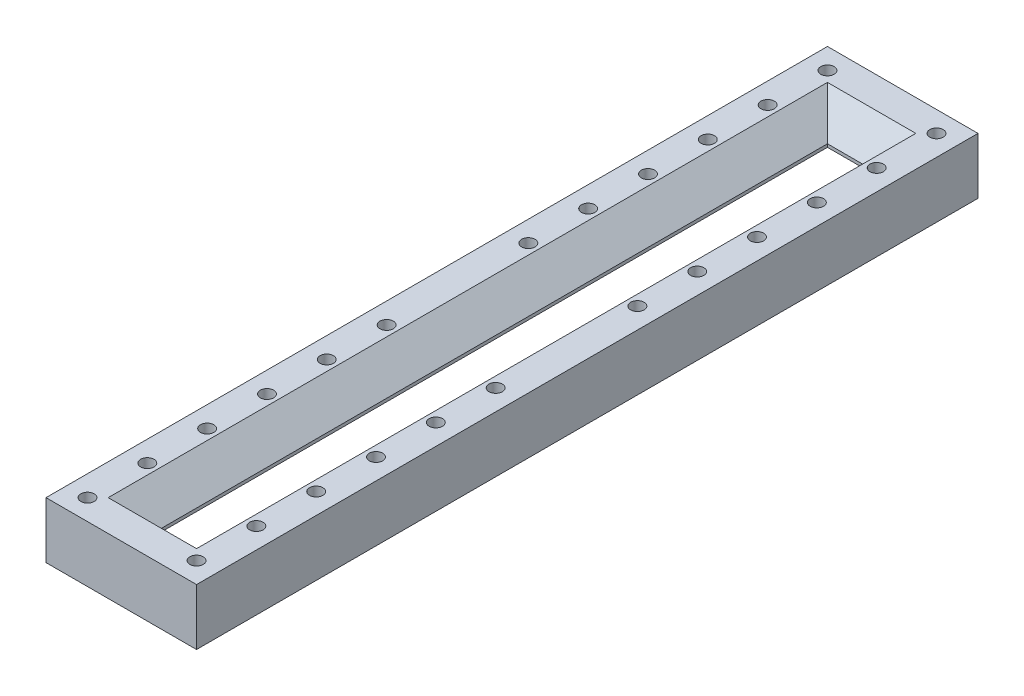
ISO-10303-21;
HEADER;
FILE_DESCRIPTION(('STEP AP214'),'2;1');
FILE_NAME('part.step','',(''),(''),'','','');
FILE_SCHEMA(('AUTOMOTIVE_DESIGN { 1 0 10303 214 1 1 1 1 }'));
ENDSEC;
DATA;
#1=APPLICATION_CONTEXT('core data for automotive mechanical design processes');
#2=APPLICATION_PROTOCOL_DEFINITION('international standard','automotive_design',2000,#1);
#3=PRODUCT_CONTEXT('',#1,'mechanical');
#4=PRODUCT('Part','Part','',(#3));
#5=PRODUCT_RELATED_PRODUCT_CATEGORY('part','',(#4));
#6=PRODUCT_DEFINITION_FORMATION('','',#4);
#7=PRODUCT_DEFINITION_CONTEXT('part definition',#1,'design');
#8=PRODUCT_DEFINITION('design','',#6,#7);
#9=PRODUCT_DEFINITION_SHAPE('','',#8);
#10=(LENGTH_UNIT() NAMED_UNIT(*) SI_UNIT(.MILLI.,.METRE.));
#11=(NAMED_UNIT(*) PLANE_ANGLE_UNIT() SI_UNIT($,.RADIAN.));
#12=(NAMED_UNIT(*) SI_UNIT($,.STERADIAN.) SOLID_ANGLE_UNIT());
#13=UNCERTAINTY_MEASURE_WITH_UNIT(LENGTH_MEASURE(1.E-05),#10,'distance_accuracy_value','');
#14=(GEOMETRIC_REPRESENTATION_CONTEXT(3) GLOBAL_UNCERTAINTY_ASSIGNED_CONTEXT((#13)) GLOBAL_UNIT_ASSIGNED_CONTEXT((#10,
#11,#12)) REPRESENTATION_CONTEXT('',''));
#15=CARTESIAN_POINT('',(0.,0.,0.));
#16=DIRECTION('',(0.,0.,1.));
#17=DIRECTION('',(1.,0.,0.));
#18=AXIS2_PLACEMENT_3D('',#15,#16,#17);
#19=CARTESIAN_POINT('',(0.,254.,0.));
#20=DIRECTION('',(0.,1.,0.));
#21=DIRECTION('',(0.,0.,1.));
#22=AXIS2_PLACEMENT_3D('',#19,#20,#21);
#23=PLANE('',#22);
#24=DIRECTION('',(1.,0.,0.));
#25=VECTOR('',#24,1.);
#26=CARTESIAN_POINT('',(0.,254.,-1623.175));
#27=LINE('',#26,#25);
#28=CARTESIAN_POINT('',(-199.374999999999,254.,-1623.175));
#29=VERTEX_POINT('',#28);
#30=CARTESIAN_POINT('',(199.375,254.,-1623.175));
#31=VERTEX_POINT('',#30);
#32=EDGE_CURVE('E187',#29,#31,#27,.T.);
#33=ORIENTED_EDGE('',*,*,#32,.T.);
#34=DIRECTION('',(0.,0.,1.));
#35=VECTOR('',#34,1.);
#36=CARTESIAN_POINT('',(199.375,254.,0.));
#37=LINE('',#36,#35);
#38=CARTESIAN_POINT('',(199.375,254.,1623.175));
#39=VERTEX_POINT('',#38);
#40=EDGE_CURVE('E186',#31,#39,#37,.T.);
#41=ORIENTED_EDGE('',*,*,#40,.T.);
#42=DIRECTION('',(-1.,0.,0.));
#43=VECTOR('',#42,1.);
#44=CARTESIAN_POINT('',(0.,254.,1623.175));
#45=LINE('',#44,#43);
#46=CARTESIAN_POINT('',(-199.374999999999,254.,1623.175));
#47=VERTEX_POINT('',#46);
#48=EDGE_CURVE('E179',#39,#47,#45,.T.);
#49=ORIENTED_EDGE('',*,*,#48,.T.);
#50=DIRECTION('',(0.,0.,-1.));
#51=VECTOR('',#50,1.);
#52=CARTESIAN_POINT('',(-199.374999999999,254.,0.));
#53=LINE('',#52,#51);
#54=EDGE_CURVE('E182',#47,#29,#53,.T.);
#55=ORIENTED_EDGE('',*,*,#54,.T.);
#56=EDGE_LOOP('',(#33,#41,#49,#55));
#57=FACE_BOUND('',#56,.T.);
#58=CARTESIAN_POINT('',(-246.062499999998,254.,-1129.8625));
#59=DIRECTION('',(0.,1.,0.));
#60=DIRECTION('',(0.,0.,1.));
#61=AXIS2_PLACEMENT_3D('',#58,#59,#60);
#62=CIRCLE('',#61,30.1625000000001);
#63=CARTESIAN_POINT('',(-246.062499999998,254.,-1099.7));
#64=VERTEX_POINT('',#63);
#65=EDGE_CURVE('E438',#64,#64,#62,.T.);
#66=ORIENTED_EDGE('',*,*,#65,.F.);
#67=EDGE_LOOP('',(#66));
#68=FACE_BOUND('',#67,.T.);
#69=CARTESIAN_POINT('',(246.062500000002,254.,-1129.8625));
#70=DIRECTION('',(0.,1.,0.));
#71=DIRECTION('',(0.,0.,1.));
#72=AXIS2_PLACEMENT_3D('',#69,#70,#71);
#73=CIRCLE('',#72,30.1625000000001);
#74=CARTESIAN_POINT('',(246.062500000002,254.,-1099.7));
#75=VERTEX_POINT('',#74);
#76=EDGE_CURVE('E550',#75,#75,#73,.T.);
#77=ORIENTED_EDGE('',*,*,#76,.F.);
#78=EDGE_LOOP('',(#77));
#79=FACE_BOUND('',#78,.T.);
#80=CARTESIAN_POINT('',(-246.062499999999,254.,-1399.8625));
#81=DIRECTION('',(0.,1.,0.));
#82=DIRECTION('',(0.,0.,1.));
#83=AXIS2_PLACEMENT_3D('',#80,#81,#82);
#84=CIRCLE('',#83,30.1625000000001);
#85=CARTESIAN_POINT('',(-246.062499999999,254.,-1369.7));
#86=VERTEX_POINT('',#85);
#87=EDGE_CURVE('E536',#86,#86,#84,.T.);
#88=ORIENTED_EDGE('',*,*,#87,.F.);
#89=EDGE_LOOP('',(#88));
#90=FACE_BOUND('',#89,.T.);
#91=CARTESIAN_POINT('',(246.062500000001,254.,-1399.8625));
#92=DIRECTION('',(0.,1.,0.));
#93=DIRECTION('',(0.,0.,1.));
#94=AXIS2_PLACEMENT_3D('',#91,#92,#93);
#95=CIRCLE('',#94,30.1625000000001);
#96=CARTESIAN_POINT('',(246.062500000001,254.,-1369.7));
#97=VERTEX_POINT('',#96);
#98=EDGE_CURVE('E532',#97,#97,#95,.T.);
#99=ORIENTED_EDGE('',*,*,#98,.F.);
#100=EDGE_LOOP('',(#99));
#101=FACE_BOUND('',#100,.T.);
#102=CARTESIAN_POINT('',(-246.062500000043,254.,859.862500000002));
#103=DIRECTION('',(0.,1.,0.));
#104=DIRECTION('',(0.,0.,1.));
#105=AXIS2_PLACEMENT_3D('',#102,#103,#104);
#106=CIRCLE('',#105,30.1625000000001);
#107=CARTESIAN_POINT('',(-246.062500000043,254.,890.025000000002));
#108=VERTEX_POINT('',#107);
#109=EDGE_CURVE('E520',#108,#108,#106,.T.);
#110=ORIENTED_EDGE('',*,*,#109,.F.);
#111=EDGE_LOOP('',(#110));
#112=FACE_BOUND('',#111,.T.);
#113=CARTESIAN_POINT('',(246.062499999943,254.,589.862500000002));
#114=DIRECTION('',(0.,1.,0.));
#115=DIRECTION('',(0.,0.,1.));
#116=AXIS2_PLACEMENT_3D('',#113,#114,#115);
#117=CIRCLE('',#116,30.1625000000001);
#118=CARTESIAN_POINT('',(246.062499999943,254.,620.025000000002));
#119=VERTEX_POINT('',#118);
#120=EDGE_CURVE('E498',#119,#119,#117,.T.);
#121=ORIENTED_EDGE('',*,*,#120,.F.);
#122=EDGE_LOOP('',(#121));
#123=FACE_BOUND('',#122,.T.);
#124=CARTESIAN_POINT('',(-246.062500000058,254.,589.862500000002));
#125=DIRECTION('',(0.,1.,0.));
#126=DIRECTION('',(0.,0.,1.));
#127=AXIS2_PLACEMENT_3D('',#124,#125,#126);
#128=CIRCLE('',#127,30.1625000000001);
#129=CARTESIAN_POINT('',(-246.062500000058,254.,620.025000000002));
#130=VERTEX_POINT('',#129);
#131=EDGE_CURVE('E497',#130,#130,#128,.T.);
#132=ORIENTED_EDGE('',*,*,#131,.F.);
#133=EDGE_LOOP('',(#132));
#134=FACE_BOUND('',#133,.T.);
#135=CARTESIAN_POINT('',(246.062500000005,254.,-319.862500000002));
#136=DIRECTION('',(0.,1.,0.));
#137=DIRECTION('',(0.,0.,1.));
#138=AXIS2_PLACEMENT_3D('',#135,#136,#137);
#139=CIRCLE('',#138,30.1625000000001);
#140=CARTESIAN_POINT('',(246.062500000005,254.,-289.700000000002));
#141=VERTEX_POINT('',#140);
#142=EDGE_CURVE('E510',#141,#141,#139,.T.);
#143=ORIENTED_EDGE('',*,*,#142,.F.);
#144=EDGE_LOOP('',(#143));
#145=FACE_BOUND('',#144,.T.);
#146=CARTESIAN_POINT('',(246.062499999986,254.,1399.8625));
#147=DIRECTION('',(0.,1.,0.));
#148=DIRECTION('',(0.,0.,1.));
#149=AXIS2_PLACEMENT_3D('',#146,#147,#148);
#150=CIRCLE('',#149,30.1625000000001);
#151=CARTESIAN_POINT('',(246.062499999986,254.,1430.025));
#152=VERTEX_POINT('',#151);
#153=EDGE_CURVE('E573',#152,#152,#150,.T.);
#154=ORIENTED_EDGE('',*,*,#153,.F.);
#155=EDGE_LOOP('',(#154));
#156=FACE_BOUND('',#155,.T.);
#157=CARTESIAN_POINT('',(-246.0625,254.,-1669.8625));
#158=DIRECTION('',(0.,1.,0.));
#159=DIRECTION('',(0.,0.,1.));
#160=AXIS2_PLACEMENT_3D('',#157,#158,#159);
#161=CIRCLE('',#160,30.1625000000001);
#162=CARTESIAN_POINT('',(-246.0625,254.,-1639.7));
#163=VERTEX_POINT('',#162);
#164=EDGE_CURVE('E593',#163,#163,#161,.T.);
#165=ORIENTED_EDGE('',*,*,#164,.F.);
#166=EDGE_LOOP('',(#165));
#167=FACE_BOUND('',#166,.T.);
#168=CARTESIAN_POINT('',(-246.0625,254.,1669.8625));
#169=DIRECTION('',(0.,1.,0.));
#170=DIRECTION('',(0.,0.,1.));
#171=AXIS2_PLACEMENT_3D('',#168,#169,#170);
#172=CIRCLE('',#171,30.1625000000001);
#173=CARTESIAN_POINT('',(-246.0625,254.,1700.025));
#174=VERTEX_POINT('',#173);
#175=EDGE_CURVE('E589',#174,#174,#172,.T.);
#176=ORIENTED_EDGE('',*,*,#175,.F.);
#177=EDGE_LOOP('',(#176));
#178=FACE_BOUND('',#177,.T.);
#179=CARTESIAN_POINT('',(246.0625,254.,-1669.8625));
#180=DIRECTION('',(0.,1.,0.));
#181=DIRECTION('',(0.,0.,1.));
#182=AXIS2_PLACEMENT_3D('',#179,#180,#181);
#183=CIRCLE('',#182,30.1625000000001);
#184=CARTESIAN_POINT('',(246.0625,254.,-1639.7));
#185=VERTEX_POINT('',#184);
#186=EDGE_CURVE('E610',#185,#185,#183,.T.);
#187=ORIENTED_EDGE('',*,*,#186,.F.);
#188=EDGE_LOOP('',(#187));
#189=FACE_BOUND('',#188,.T.);
#190=CARTESIAN_POINT('',(246.062499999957,254.,859.862500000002));
#191=DIRECTION('',(0.,1.,0.));
#192=DIRECTION('',(0.,0.,1.));
#193=AXIS2_PLACEMENT_3D('',#190,#191,#192);
#194=CIRCLE('',#193,30.1625000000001);
#195=CARTESIAN_POINT('',(246.062499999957,254.,890.025000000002));
#196=VERTEX_POINT('',#195);
#197=EDGE_CURVE('E517',#196,#196,#194,.T.);
#198=ORIENTED_EDGE('',*,*,#197,.F.);
#199=EDGE_LOOP('',(#198));
#200=FACE_BOUND('',#199,.T.);
#201=CARTESIAN_POINT('',(-246.062500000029,254.,1129.8625));
#202=DIRECTION('',(0.,1.,0.));
#203=DIRECTION('',(0.,0.,1.));
#204=AXIS2_PLACEMENT_3D('',#201,#202,#203);
#205=CIRCLE('',#204,30.1625000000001);
#206=CARTESIAN_POINT('',(-246.062500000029,254.,1160.025));
#207=VERTEX_POINT('',#206);
#208=EDGE_CURVE('E559',#207,#207,#205,.T.);
#209=ORIENTED_EDGE('',*,*,#208,.F.);
#210=EDGE_LOOP('',(#209));
#211=FACE_BOUND('',#210,.T.);
#212=CARTESIAN_POINT('',(246.062499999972,254.,1129.8625));
#213=DIRECTION('',(0.,1.,0.));
#214=DIRECTION('',(0.,0.,1.));
#215=AXIS2_PLACEMENT_3D('',#212,#213,#214);
#216=CIRCLE('',#215,30.1625000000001);
#217=CARTESIAN_POINT('',(246.062499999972,254.,1160.025));
#218=VERTEX_POINT('',#217);
#219=EDGE_CURVE('E556',#218,#218,#216,.T.);
#220=ORIENTED_EDGE('',*,*,#219,.F.);
#221=EDGE_LOOP('',(#220));
#222=FACE_BOUND('',#221,.T.);
#223=CARTESIAN_POINT('',(-246.062500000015,254.,1399.8625));
#224=DIRECTION('',(0.,1.,0.));
#225=DIRECTION('',(0.,0.,1.));
#226=AXIS2_PLACEMENT_3D('',#223,#224,#225);
#227=CIRCLE('',#226,30.1625000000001);
#228=CARTESIAN_POINT('',(-246.062500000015,254.,1430.025));
#229=VERTEX_POINT('',#228);
#230=EDGE_CURVE('E574',#229,#229,#227,.T.);
#231=ORIENTED_EDGE('',*,*,#230,.F.);
#232=EDGE_LOOP('',(#231));
#233=FACE_BOUND('',#232,.T.);
#234=CARTESIAN_POINT('',(246.062500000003,254.,-859.862500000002));
#235=DIRECTION('',(0.,1.,0.));
#236=DIRECTION('',(0.,0.,1.));
#237=AXIS2_PLACEMENT_3D('',#234,#235,#236);
#238=CIRCLE('',#237,30.1625000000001);
#239=CARTESIAN_POINT('',(246.062500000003,254.,-829.700000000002));
#240=VERTEX_POINT('',#239);
#241=EDGE_CURVE('E435',#240,#240,#238,.T.);
#242=ORIENTED_EDGE('',*,*,#241,.F.);
#243=EDGE_LOOP('',(#242));
#244=FACE_BOUND('',#243,.T.);
#245=CARTESIAN_POINT('',(-246.062499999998,254.,-859.862500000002));
#246=DIRECTION('',(0.,1.,0.));
#247=DIRECTION('',(0.,0.,1.));
#248=AXIS2_PLACEMENT_3D('',#245,#246,#247);
#249=CIRCLE('',#248,30.1625000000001);
#250=CARTESIAN_POINT('',(-246.062499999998,254.,-829.700000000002));
#251=VERTEX_POINT('',#250);
#252=EDGE_CURVE('E452',#251,#251,#249,.T.);
#253=ORIENTED_EDGE('',*,*,#252,.F.);
#254=EDGE_LOOP('',(#253));
#255=FACE_BOUND('',#254,.T.);
#256=CARTESIAN_POINT('',(246.062500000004,254.,-589.862500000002));
#257=DIRECTION('',(0.,1.,0.));
#258=DIRECTION('',(0.,0.,1.));
#259=AXIS2_PLACEMENT_3D('',#256,#257,#258);
#260=CIRCLE('',#259,30.1625000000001);
#261=CARTESIAN_POINT('',(246.062500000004,254.,-559.700000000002));
#262=VERTEX_POINT('',#261);
#263=EDGE_CURVE('E458',#262,#262,#260,.T.);
#264=ORIENTED_EDGE('',*,*,#263,.F.);
#265=EDGE_LOOP('',(#264));
#266=FACE_BOUND('',#265,.T.);
#267=CARTESIAN_POINT('',(-246.062499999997,254.,-589.862500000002));
#268=DIRECTION('',(0.,1.,0.));
#269=DIRECTION('',(0.,0.,1.));
#270=AXIS2_PLACEMENT_3D('',#267,#268,#269);
#271=CIRCLE('',#270,30.1625000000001);
#272=CARTESIAN_POINT('',(-246.062499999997,254.,-559.700000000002));
#273=VERTEX_POINT('',#272);
#274=EDGE_CURVE('E470',#273,#273,#271,.T.);
#275=ORIENTED_EDGE('',*,*,#274,.F.);
#276=EDGE_LOOP('',(#275));
#277=FACE_BOUND('',#276,.T.);
#278=CARTESIAN_POINT('',(-246.062500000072,254.,319.862500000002));
#279=DIRECTION('',(0.,1.,0.));
#280=DIRECTION('',(0.,0.,1.));
#281=AXIS2_PLACEMENT_3D('',#278,#279,#280);
#282=CIRCLE('',#281,30.1625000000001);
#283=CARTESIAN_POINT('',(-246.062500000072,254.,350.025000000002));
#284=VERTEX_POINT('',#283);
#285=EDGE_CURVE('E234',#284,#284,#282,.T.);
#286=ORIENTED_EDGE('',*,*,#285,.F.);
#287=EDGE_LOOP('',(#286));
#288=FACE_BOUND('',#287,.T.);
#289=CARTESIAN_POINT('',(246.062499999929,254.,319.862500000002));
#290=DIRECTION('',(0.,1.,0.));
#291=DIRECTION('',(0.,0.,1.));
#292=AXIS2_PLACEMENT_3D('',#289,#290,#291);
#293=CIRCLE('',#292,30.1625000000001);
#294=CARTESIAN_POINT('',(246.062499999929,254.,350.025000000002));
#295=VERTEX_POINT('',#294);
#296=EDGE_CURVE('E476',#295,#295,#293,.T.);
#297=ORIENTED_EDGE('',*,*,#296,.F.);
#298=EDGE_LOOP('',(#297));
#299=FACE_BOUND('',#298,.T.);
#300=CARTESIAN_POINT('',(-246.062499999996,254.,-319.862500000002));
#301=DIRECTION('',(0.,1.,0.));
#302=DIRECTION('',(0.,0.,1.));
#303=AXIS2_PLACEMENT_3D('',#300,#301,#302);
#304=CIRCLE('',#303,30.1625000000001);
#305=CARTESIAN_POINT('',(-246.062499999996,254.,-289.700000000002));
#306=VERTEX_POINT('',#305);
#307=EDGE_CURVE('E481',#306,#306,#304,.T.);
#308=ORIENTED_EDGE('',*,*,#307,.F.);
#309=EDGE_LOOP('',(#308));
#310=FACE_BOUND('',#309,.T.);
#311=CARTESIAN_POINT('',(246.0625,254.,1669.8625));
#312=DIRECTION('',(0.,1.,0.));
#313=DIRECTION('',(0.,0.,1.));
#314=AXIS2_PLACEMENT_3D('',#311,#312,#313);
#315=CIRCLE('',#314,30.1625000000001);
#316=CARTESIAN_POINT('',(246.0625,254.,1700.025));
#317=VERTEX_POINT('',#316);
#318=EDGE_CURVE('E616',#317,#317,#315,.T.);
#319=ORIENTED_EDGE('',*,*,#318,.F.);
#320=EDGE_LOOP('',(#319));
#321=FACE_BOUND('',#320,.T.);
#322=DIRECTION('',(0.,0.,-1.));
#323=VECTOR('',#322,1.);
#324=CARTESIAN_POINT('',(339.724999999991,254.,1763.525));
#325=LINE('',#324,#323);
#326=CARTESIAN_POINT('',(339.724999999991,254.,1763.525));
#327=VERTEX_POINT('',#326);
#328=CARTESIAN_POINT('',(339.72499999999,254.,-1763.525));
#329=VERTEX_POINT('',#328);
#330=EDGE_CURVE('E155',#327,#329,#325,.T.);
#331=ORIENTED_EDGE('',*,*,#330,.T.);
#332=DIRECTION('',(-1.,0.,0.));
#333=VECTOR('',#332,1.);
#334=CARTESIAN_POINT('',(339.72499999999,254.,-1763.525));
#335=LINE('',#334,#333);
#336=CARTESIAN_POINT('',(-339.725000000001,254.,-1763.525));
#337=VERTEX_POINT('',#336);
#338=EDGE_CURVE('E139',#329,#337,#335,.T.);
#339=ORIENTED_EDGE('',*,*,#338,.T.);
#340=DIRECTION('',(0.,0.,1.));
#341=VECTOR('',#340,1.);
#342=CARTESIAN_POINT('',(-339.725,254.,1763.525));
#343=LINE('',#342,#341);
#344=CARTESIAN_POINT('',(-339.725,254.,1763.525));
#345=VERTEX_POINT('',#344);
#346=EDGE_CURVE('E151',#337,#345,#343,.T.);
#347=ORIENTED_EDGE('',*,*,#346,.T.);
#348=DIRECTION('',(1.,0.,0.));
#349=VECTOR('',#348,1.);
#350=CARTESIAN_POINT('',(339.724999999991,254.,1763.525));
#351=LINE('',#350,#349);
#352=EDGE_CURVE('E158',#345,#327,#351,.T.);
#353=ORIENTED_EDGE('',*,*,#352,.T.);
#354=EDGE_LOOP('',(#331,#339,#347,#353));
#355=FACE_BOUND('',#354,.T.);
#356=ADVANCED_FACE('F46',(#57,#68,#79,#90,#101,#112,#123,#134,#145,#156,#167,#178,#189,#200,
#211,#222,#233,#244,#255,#266,#277,#288,#299,#310,#321,#355),#23,.T.);
#357=CARTESIAN_POINT('',(0.,0.,0.));
#358=DIRECTION('',(0.,1.,0.));
#359=DIRECTION('',(0.,0.,1.));
#360=AXIS2_PLACEMENT_3D('',#357,#358,#359);
#361=PLANE('',#360);
#362=DIRECTION('',(0.,0.,-1.));
#363=VECTOR('',#362,1.);
#364=CARTESIAN_POINT('',(199.375,0.,-1503.175));
#365=LINE('',#364,#363);
#366=CARTESIAN_POINT('',(199.375,0.,1623.175));
#367=VERTEX_POINT('',#366);
#368=CARTESIAN_POINT('',(199.375,0.,-1623.175));
#369=VERTEX_POINT('',#368);
#370=EDGE_CURVE('E60',#367,#369,#365,.T.);
#371=ORIENTED_EDGE('',*,*,#370,.T.);
#372=DIRECTION('',(-1.,0.,0.));
#373=VECTOR('',#372,1.);
#374=CARTESIAN_POINT('',(-79.3749999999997,0.,-1623.175));
#375=LINE('',#374,#373);
#376=CARTESIAN_POINT('',(-199.374999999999,0.,-1623.175));
#377=VERTEX_POINT('',#376);
#378=EDGE_CURVE('E11',#369,#377,#375,.T.);
#379=ORIENTED_EDGE('',*,*,#378,.T.);
#380=DIRECTION('',(0.,0.,1.));
#381=VECTOR('',#380,1.);
#382=CARTESIAN_POINT('',(-199.374999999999,0.,1503.175));
#383=LINE('',#382,#381);
#384=CARTESIAN_POINT('',(-199.374999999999,0.,1623.175));
#385=VERTEX_POINT('',#384);
#386=EDGE_CURVE('E213',#377,#385,#383,.T.);
#387=ORIENTED_EDGE('',*,*,#386,.T.);
#388=DIRECTION('',(1.,0.,0.));
#389=VECTOR('',#388,1.);
#390=CARTESIAN_POINT('',(79.3750000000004,0.,1623.175));
#391=LINE('',#390,#389);
#392=EDGE_CURVE('E215',#385,#367,#391,.T.);
#393=ORIENTED_EDGE('',*,*,#392,.T.);
#394=EDGE_LOOP('',(#371,#379,#387,#393));
#395=FACE_BOUND('',#394,.T.);
#396=CARTESIAN_POINT('',(-246.062499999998,0.,-1129.8625));
#397=DIRECTION('',(0.,1.,0.));
#398=DIRECTION('',(0.,0.,1.));
#399=AXIS2_PLACEMENT_3D('',#396,#397,#398);
#400=CIRCLE('',#399,30.1625000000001);
#401=CARTESIAN_POINT('',(-246.062499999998,0.,-1099.7));
#402=VERTEX_POINT('',#401);
#403=EDGE_CURVE('E442',#402,#402,#400,.T.);
#404=ORIENTED_EDGE('',*,*,#403,.T.);
#405=EDGE_LOOP('',(#404));
#406=FACE_BOUND('',#405,.T.);
#407=CARTESIAN_POINT('',(246.062500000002,0.,-1129.8625));
#408=DIRECTION('',(0.,1.,0.));
#409=DIRECTION('',(0.,0.,1.));
#410=AXIS2_PLACEMENT_3D('',#407,#408,#409);
#411=CIRCLE('',#410,30.1625000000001);
#412=CARTESIAN_POINT('',(246.062500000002,0.,-1099.7));
#413=VERTEX_POINT('',#412);
#414=EDGE_CURVE('E542',#413,#413,#411,.T.);
#415=ORIENTED_EDGE('',*,*,#414,.T.);
#416=EDGE_LOOP('',(#415));
#417=FACE_BOUND('',#416,.T.);
#418=CARTESIAN_POINT('',(-246.062499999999,0.,-1399.8625));
#419=DIRECTION('',(0.,1.,0.));
#420=DIRECTION('',(0.,0.,1.));
#421=AXIS2_PLACEMENT_3D('',#418,#419,#420);
#422=CIRCLE('',#421,30.1625000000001);
#423=CARTESIAN_POINT('',(-246.062499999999,0.,-1369.7));
#424=VERTEX_POINT('',#423);
#425=EDGE_CURVE('E533',#424,#424,#422,.T.);
#426=ORIENTED_EDGE('',*,*,#425,.T.);
#427=EDGE_LOOP('',(#426));
#428=FACE_BOUND('',#427,.T.);
#429=CARTESIAN_POINT('',(246.062500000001,0.,-1399.8625));
#430=DIRECTION('',(0.,1.,0.));
#431=DIRECTION('',(0.,0.,1.));
#432=AXIS2_PLACEMENT_3D('',#429,#430,#431);
#433=CIRCLE('',#432,30.1625000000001);
#434=CARTESIAN_POINT('',(246.062500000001,0.,-1369.7));
#435=VERTEX_POINT('',#434);
#436=EDGE_CURVE('E512',#435,#435,#433,.T.);
#437=ORIENTED_EDGE('',*,*,#436,.T.);
#438=EDGE_LOOP('',(#437));
#439=FACE_BOUND('',#438,.T.);
#440=CARTESIAN_POINT('',(-246.062500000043,0.,859.862500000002));
#441=DIRECTION('',(0.,1.,0.));
#442=DIRECTION('',(0.,0.,1.));
#443=AXIS2_PLACEMENT_3D('',#440,#441,#442);
#444=CIRCLE('',#443,30.1625000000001);
#445=CARTESIAN_POINT('',(-246.062500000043,0.,890.025000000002));
#446=VERTEX_POINT('',#445);
#447=EDGE_CURVE('E515',#446,#446,#444,.T.);
#448=ORIENTED_EDGE('',*,*,#447,.T.);
#449=EDGE_LOOP('',(#448));
#450=FACE_BOUND('',#449,.T.);
#451=CARTESIAN_POINT('',(246.062499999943,0.,589.862500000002));
#452=DIRECTION('',(0.,1.,0.));
#453=DIRECTION('',(0.,0.,1.));
#454=AXIS2_PLACEMENT_3D('',#451,#452,#453);
#455=CIRCLE('',#454,30.1625000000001);
#456=CARTESIAN_POINT('',(246.062499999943,0.,620.025000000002));
#457=VERTEX_POINT('',#456);
#458=EDGE_CURVE('E521',#457,#457,#455,.T.);
#459=ORIENTED_EDGE('',*,*,#458,.T.);
#460=EDGE_LOOP('',(#459));
#461=FACE_BOUND('',#460,.T.);
#462=CARTESIAN_POINT('',(-246.062500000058,0.,589.862500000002));
#463=DIRECTION('',(0.,1.,0.));
#464=DIRECTION('',(0.,0.,1.));
#465=AXIS2_PLACEMENT_3D('',#462,#463,#464);
#466=CIRCLE('',#465,30.1625000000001);
#467=CARTESIAN_POINT('',(-246.062500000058,0.,620.025000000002));
#468=VERTEX_POINT('',#467);
#469=EDGE_CURVE('E494',#468,#468,#466,.T.);
#470=ORIENTED_EDGE('',*,*,#469,.T.);
#471=EDGE_LOOP('',(#470));
#472=FACE_BOUND('',#471,.T.);
#473=CARTESIAN_POINT('',(246.062500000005,0.,-319.862500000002));
#474=DIRECTION('',(0.,1.,0.));
#475=DIRECTION('',(0.,0.,1.));
#476=AXIS2_PLACEMENT_3D('',#473,#474,#475);
#477=CIRCLE('',#476,30.1625000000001);
#478=CARTESIAN_POINT('',(246.062500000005,0.,-289.700000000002));
#479=VERTEX_POINT('',#478);
#480=EDGE_CURVE('E503',#479,#479,#477,.T.);
#481=ORIENTED_EDGE('',*,*,#480,.T.);
#482=EDGE_LOOP('',(#481));
#483=FACE_BOUND('',#482,.T.);
#484=CARTESIAN_POINT('',(246.062499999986,0.,1399.8625));
#485=DIRECTION('',(0.,1.,0.));
#486=DIRECTION('',(0.,0.,1.));
#487=AXIS2_PLACEMENT_3D('',#484,#485,#486);
#488=CIRCLE('',#487,30.1625000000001);
#489=CARTESIAN_POINT('',(246.062499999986,0.,1430.025));
#490=VERTEX_POINT('',#489);
#491=EDGE_CURVE('E594',#490,#490,#488,.T.);
#492=ORIENTED_EDGE('',*,*,#491,.T.);
#493=EDGE_LOOP('',(#492));
#494=FACE_BOUND('',#493,.T.);
#495=CARTESIAN_POINT('',(-246.0625,0.,-1669.8625));
#496=DIRECTION('',(0.,1.,0.));
#497=DIRECTION('',(0.,0.,1.));
#498=AXIS2_PLACEMENT_3D('',#495,#496,#497);
#499=CIRCLE('',#498,30.1625000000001);
#500=CARTESIAN_POINT('',(-246.0625,0.,-1639.7));
#501=VERTEX_POINT('',#500);
#502=EDGE_CURVE('E586',#501,#501,#499,.T.);
#503=ORIENTED_EDGE('',*,*,#502,.T.);
#504=EDGE_LOOP('',(#503));
#505=FACE_BOUND('',#504,.T.);
#506=CARTESIAN_POINT('',(-246.0625,0.,1669.8625));
#507=DIRECTION('',(0.,1.,0.));
#508=DIRECTION('',(0.,0.,1.));
#509=AXIS2_PLACEMENT_3D('',#506,#507,#508);
#510=CIRCLE('',#509,30.1625000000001);
#511=CARTESIAN_POINT('',(-246.0625,0.,1700.025));
#512=VERTEX_POINT('',#511);
#513=EDGE_CURVE('E613',#512,#512,#510,.T.);
#514=ORIENTED_EDGE('',*,*,#513,.T.);
#515=EDGE_LOOP('',(#514));
#516=FACE_BOUND('',#515,.T.);
#517=CARTESIAN_POINT('',(246.0625,0.,-1669.8625));
#518=DIRECTION('',(0.,1.,0.));
#519=DIRECTION('',(0.,0.,1.));
#520=AXIS2_PLACEMENT_3D('',#517,#518,#519);
#521=CIRCLE('',#520,30.1625000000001);
#522=CARTESIAN_POINT('',(246.0625,0.,-1639.7));
#523=VERTEX_POINT('',#522);
#524=EDGE_CURVE('E605',#523,#523,#521,.T.);
#525=ORIENTED_EDGE('',*,*,#524,.T.);
#526=EDGE_LOOP('',(#525));
#527=FACE_BOUND('',#526,.T.);
#528=CARTESIAN_POINT('',(246.062499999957,0.,859.862500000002));
#529=DIRECTION('',(0.,1.,0.));
#530=DIRECTION('',(0.,0.,1.));
#531=AXIS2_PLACEMENT_3D('',#528,#529,#530);
#532=CIRCLE('',#531,30.1625000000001);
#533=CARTESIAN_POINT('',(246.062499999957,0.,890.025000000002));
#534=VERTEX_POINT('',#533);
#535=EDGE_CURVE('E563',#534,#534,#532,.T.);
#536=ORIENTED_EDGE('',*,*,#535,.T.);
#537=EDGE_LOOP('',(#536));
#538=FACE_BOUND('',#537,.T.);
#539=CARTESIAN_POINT('',(-246.062500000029,0.,1129.8625));
#540=DIRECTION('',(0.,1.,0.));
#541=DIRECTION('',(0.,0.,1.));
#542=AXIS2_PLACEMENT_3D('',#539,#540,#541);
#543=CIRCLE('',#542,30.1625000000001);
#544=CARTESIAN_POINT('',(-246.062500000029,0.,1160.025));
#545=VERTEX_POINT('',#544);
#546=EDGE_CURVE('E555',#545,#545,#543,.T.);
#547=ORIENTED_EDGE('',*,*,#546,.T.);
#548=EDGE_LOOP('',(#547));
#549=FACE_BOUND('',#548,.T.);
#550=CARTESIAN_POINT('',(246.062499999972,0.,1129.8625));
#551=DIRECTION('',(0.,1.,0.));
#552=DIRECTION('',(0.,0.,1.));
#553=AXIS2_PLACEMENT_3D('',#550,#551,#552);
#554=CIRCLE('',#553,30.1625000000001);
#555=CARTESIAN_POINT('',(246.062499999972,0.,1160.025));
#556=VERTEX_POINT('',#555);
#557=EDGE_CURVE('E576',#556,#556,#554,.T.);
#558=ORIENTED_EDGE('',*,*,#557,.T.);
#559=EDGE_LOOP('',(#558));
#560=FACE_BOUND('',#559,.T.);
#561=CARTESIAN_POINT('',(-246.062500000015,0.,1399.8625));
#562=DIRECTION('',(0.,1.,0.));
#563=DIRECTION('',(0.,0.,1.));
#564=AXIS2_PLACEMENT_3D('',#561,#562,#563);
#565=CIRCLE('',#564,30.1625000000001);
#566=CARTESIAN_POINT('',(-246.062500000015,0.,1430.025));
#567=VERTEX_POINT('',#566);
#568=EDGE_CURVE('E569',#567,#567,#565,.T.);
#569=ORIENTED_EDGE('',*,*,#568,.T.);
#570=EDGE_LOOP('',(#569));
#571=FACE_BOUND('',#570,.T.);
#572=CARTESIAN_POINT('',(246.062500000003,0.,-859.862500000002));
#573=DIRECTION('',(0.,1.,0.));
#574=DIRECTION('',(0.,0.,1.));
#575=AXIS2_PLACEMENT_3D('',#572,#573,#574);
#576=CIRCLE('',#575,30.1625000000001);
#577=CARTESIAN_POINT('',(246.062500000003,0.,-829.700000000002));
#578=VERTEX_POINT('',#577);
#579=EDGE_CURVE('E434',#578,#578,#576,.T.);
#580=ORIENTED_EDGE('',*,*,#579,.T.);
#581=EDGE_LOOP('',(#580));
#582=FACE_BOUND('',#581,.T.);
#583=CARTESIAN_POINT('',(-246.062499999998,0.,-859.862500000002));
#584=DIRECTION('',(0.,1.,0.));
#585=DIRECTION('',(0.,0.,1.));
#586=AXIS2_PLACEMENT_3D('',#583,#584,#585);
#587=CIRCLE('',#586,30.1625000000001);
#588=CARTESIAN_POINT('',(-246.062499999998,0.,-829.700000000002));
#589=VERTEX_POINT('',#588);
#590=EDGE_CURVE('E444',#589,#589,#587,.T.);
#591=ORIENTED_EDGE('',*,*,#590,.T.);
#592=EDGE_LOOP('',(#591));
#593=FACE_BOUND('',#592,.T.);
#594=CARTESIAN_POINT('',(246.062500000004,0.,-589.862500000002));
#595=DIRECTION('',(0.,1.,0.));
#596=DIRECTION('',(0.,0.,1.));
#597=AXIS2_PLACEMENT_3D('',#594,#595,#596);
#598=CIRCLE('',#597,30.1625000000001);
#599=CARTESIAN_POINT('',(246.062500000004,0.,-559.700000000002));
#600=VERTEX_POINT('',#599);
#601=EDGE_CURVE('E453',#600,#600,#598,.T.);
#602=ORIENTED_EDGE('',*,*,#601,.T.);
#603=EDGE_LOOP('',(#602));
#604=FACE_BOUND('',#603,.T.);
#605=CARTESIAN_POINT('',(-246.062499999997,0.,-589.862500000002));
#606=DIRECTION('',(0.,1.,0.));
#607=DIRECTION('',(0.,0.,1.));
#608=AXIS2_PLACEMENT_3D('',#605,#606,#607);
#609=CIRCLE('',#608,30.1625000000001);
#610=CARTESIAN_POINT('',(-246.062499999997,0.,-559.700000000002));
#611=VERTEX_POINT('',#610);
#612=EDGE_CURVE('E461',#611,#611,#609,.T.);
#613=ORIENTED_EDGE('',*,*,#612,.T.);
#614=EDGE_LOOP('',(#613));
#615=FACE_BOUND('',#614,.T.);
#616=CARTESIAN_POINT('',(-246.062500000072,0.,319.862500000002));
#617=DIRECTION('',(0.,1.,0.));
#618=DIRECTION('',(0.,0.,1.));
#619=AXIS2_PLACEMENT_3D('',#616,#617,#618);
#620=CIRCLE('',#619,30.1625000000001);
#621=CARTESIAN_POINT('',(-246.062500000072,0.,350.025000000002));
#622=VERTEX_POINT('',#621);
#623=EDGE_CURVE('E475',#622,#622,#620,.T.);
#624=ORIENTED_EDGE('',*,*,#623,.T.);
#625=EDGE_LOOP('',(#624));
#626=FACE_BOUND('',#625,.T.);
#627=CARTESIAN_POINT('',(246.062499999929,0.,319.862500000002));
#628=DIRECTION('',(0.,1.,0.));
#629=DIRECTION('',(0.,0.,1.));
#630=AXIS2_PLACEMENT_3D('',#627,#628,#629);
#631=CIRCLE('',#630,30.1625000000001);
#632=CARTESIAN_POINT('',(246.062499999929,0.,350.025000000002));
#633=VERTEX_POINT('',#632);
#634=EDGE_CURVE('E487',#633,#633,#631,.T.);
#635=ORIENTED_EDGE('',*,*,#634,.T.);
#636=EDGE_LOOP('',(#635));
#637=FACE_BOUND('',#636,.T.);
#638=CARTESIAN_POINT('',(-246.062499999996,0.,-319.862500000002));
#639=DIRECTION('',(0.,1.,0.));
#640=DIRECTION('',(0.,0.,1.));
#641=AXIS2_PLACEMENT_3D('',#638,#639,#640);
#642=CIRCLE('',#641,30.1625000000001);
#643=CARTESIAN_POINT('',(-246.062499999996,0.,-289.700000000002));
#644=VERTEX_POINT('',#643);
#645=EDGE_CURVE('E472',#644,#644,#642,.T.);
#646=ORIENTED_EDGE('',*,*,#645,.T.);
#647=EDGE_LOOP('',(#646));
#648=FACE_BOUND('',#647,.T.);
#649=CARTESIAN_POINT('',(246.0625,0.,1669.8625));
#650=DIRECTION('',(0.,1.,0.));
#651=DIRECTION('',(0.,0.,1.));
#652=AXIS2_PLACEMENT_3D('',#649,#650,#651);
#653=CIRCLE('',#652,30.1625000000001);
#654=CARTESIAN_POINT('',(246.0625,0.,1700.025));
#655=VERTEX_POINT('',#654);
#656=EDGE_CURVE('E606',#655,#655,#653,.T.);
#657=ORIENTED_EDGE('',*,*,#656,.T.);
#658=EDGE_LOOP('',(#657));
#659=FACE_BOUND('',#658,.T.);
#660=DIRECTION('',(0.,0.,-1.));
#661=VECTOR('',#660,1.);
#662=CARTESIAN_POINT('',(339.724999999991,0.,1763.525));
#663=LINE('',#662,#661);
#664=CARTESIAN_POINT('',(339.724999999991,0.,1763.525));
#665=VERTEX_POINT('',#664);
#666=CARTESIAN_POINT('',(339.72499999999,0.,-1763.525));
#667=VERTEX_POINT('',#666);
#668=EDGE_CURVE('E164',#665,#667,#663,.T.);
#669=ORIENTED_EDGE('',*,*,#668,.F.);
#670=DIRECTION('',(1.,0.,0.));
#671=VECTOR('',#670,1.);
#672=CARTESIAN_POINT('',(339.724999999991,0.,1763.525));
#673=LINE('',#672,#671);
#674=CARTESIAN_POINT('',(-339.725,0.,1763.525));
#675=VERTEX_POINT('',#674);
#676=EDGE_CURVE('E163',#675,#665,#673,.T.);
#677=ORIENTED_EDGE('',*,*,#676,.F.);
#678=DIRECTION('',(0.,0.,1.));
#679=VECTOR('',#678,1.);
#680=CARTESIAN_POINT('',(-339.725,0.,1763.525));
#681=LINE('',#680,#679);
#682=CARTESIAN_POINT('',(-339.725000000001,0.,-1763.525));
#683=VERTEX_POINT('',#682);
#684=EDGE_CURVE('E284',#683,#675,#681,.T.);
#685=ORIENTED_EDGE('',*,*,#684,.F.);
#686=DIRECTION('',(-1.,0.,0.));
#687=VECTOR('',#686,1.);
#688=CARTESIAN_POINT('',(339.72499999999,0.,-1763.525));
#689=LINE('',#688,#687);
#690=EDGE_CURVE('E275',#667,#683,#689,.T.);
#691=ORIENTED_EDGE('',*,*,#690,.F.);
#692=EDGE_LOOP('',(#669,#677,#685,#691));
#693=FACE_BOUND('',#692,.T.);
#694=ADVANCED_FACE('F297',(#395,#406,#417,#428,#439,#450,#461,#472,#483,#494,#505,#516,#527,
#538,#549,#560,#571,#582,#593,#604,#615,#626,#637,#648,#659,#693),#361,.F.);
#695=CARTESIAN_POINT('',(339.724999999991,254.,1763.525));
#696=DIRECTION('',(-1.,0.,0.));
#697=DIRECTION('',(0.,0.,1.));
#698=AXIS2_PLACEMENT_3D('',#695,#696,#697);
#699=PLANE('',#698);
#700=ORIENTED_EDGE('',*,*,#668,.T.);
#701=DIRECTION('',(0.,-1.,0.));
#702=VECTOR('',#701,1.);
#703=CARTESIAN_POINT('',(339.72499999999,254.,-1763.525));
#704=LINE('',#703,#702);
#705=EDGE_CURVE('E144',#329,#667,#704,.T.);
#706=ORIENTED_EDGE('',*,*,#705,.F.);
#707=ORIENTED_EDGE('',*,*,#330,.F.);
#708=DIRECTION('',(0.,-1.,0.));
#709=VECTOR('',#708,1.);
#710=CARTESIAN_POINT('',(339.724999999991,254.,1763.525));
#711=LINE('',#710,#709);
#712=EDGE_CURVE('E281',#327,#665,#711,.T.);
#713=ORIENTED_EDGE('',*,*,#712,.T.);
#714=EDGE_LOOP('',(#700,#706,#707,#713));
#715=FACE_BOUND('',#714,.T.);
#716=ADVANCED_FACE('F161',(#715),#699,.F.);
#717=CARTESIAN_POINT('',(339.72499999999,254.,-1763.525));
#718=DIRECTION('',(0.,0.,1.));
#719=DIRECTION('',(1.,0.,0.));
#720=AXIS2_PLACEMENT_3D('',#717,#718,#719);
#721=PLANE('',#720);
#722=ORIENTED_EDGE('',*,*,#690,.T.);
#723=DIRECTION('',(0.,-1.,0.));
#724=VECTOR('',#723,1.);
#725=CARTESIAN_POINT('',(-339.725000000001,254.,-1763.525));
#726=LINE('',#725,#724);
#727=EDGE_CURVE('E150',#337,#683,#726,.T.);
#728=ORIENTED_EDGE('',*,*,#727,.F.);
#729=ORIENTED_EDGE('',*,*,#338,.F.);
#730=ORIENTED_EDGE('',*,*,#705,.T.);
#731=EDGE_LOOP('',(#722,#728,#729,#730));
#732=FACE_BOUND('',#731,.T.);
#733=ADVANCED_FACE('F145',(#732),#721,.F.);
#734=CARTESIAN_POINT('',(-339.725,254.,1763.525));
#735=DIRECTION('',(1.,0.,0.));
#736=DIRECTION('',(0.,0.,-1.));
#737=AXIS2_PLACEMENT_3D('',#734,#735,#736);
#738=PLANE('',#737);
#739=ORIENTED_EDGE('',*,*,#684,.T.);
#740=DIRECTION('',(0.,-1.,0.));
#741=VECTOR('',#740,1.);
#742=CARTESIAN_POINT('',(-339.725,254.,1763.525));
#743=LINE('',#742,#741);
#744=EDGE_CURVE('E173',#345,#675,#743,.T.);
#745=ORIENTED_EDGE('',*,*,#744,.F.);
#746=ORIENTED_EDGE('',*,*,#346,.F.);
#747=ORIENTED_EDGE('',*,*,#727,.T.);
#748=EDGE_LOOP('',(#739,#745,#746,#747));
#749=FACE_BOUND('',#748,.T.);
#750=ADVANCED_FACE('F301',(#749),#738,.F.);
#751=CARTESIAN_POINT('',(339.724999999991,254.,1763.525));
#752=DIRECTION('',(0.,0.,-1.));
#753=DIRECTION('',(-1.,0.,0.));
#754=AXIS2_PLACEMENT_3D('',#751,#752,#753);
#755=PLANE('',#754);
#756=ORIENTED_EDGE('',*,*,#676,.T.);
#757=ORIENTED_EDGE('',*,*,#712,.F.);
#758=ORIENTED_EDGE('',*,*,#352,.F.);
#759=ORIENTED_EDGE('',*,*,#744,.T.);
#760=EDGE_LOOP('',(#756,#757,#758,#759));
#761=FACE_BOUND('',#760,.T.);
#762=ADVANCED_FACE('F298',(#761),#755,.F.);
#763=CARTESIAN_POINT('',(-79.3749999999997,254.,-1503.175));
#764=DIRECTION('',(1.,0.,0.));
#765=DIRECTION('',(0.,0.,-1.));
#766=AXIS2_PLACEMENT_3D('',#763,#764,#765);
#767=PLANE('',#766);
#768=DIRECTION('',(0.,-1.,0.));
#769=VECTOR('',#768,1.);
#770=CARTESIAN_POINT('',(-79.3749999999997,254.,-1503.175));
#771=LINE('',#770,#769);
#772=CARTESIAN_POINT('',(-79.3749999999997,134.000000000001,-1503.175));
#773=VERTEX_POINT('',#772);
#774=CARTESIAN_POINT('',(-79.3749999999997,120.,-1503.175));
#775=VERTEX_POINT('',#774);
#776=EDGE_CURVE('E625',#773,#775,#771,.T.);
#777=ORIENTED_EDGE('',*,*,#776,.F.);
#778=DIRECTION('',(0.,0.,1.));
#779=VECTOR('',#778,1.);
#780=CARTESIAN_POINT('',(-79.3749999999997,134.000000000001,-1503.175));
#781=LINE('',#780,#779);
#782=CARTESIAN_POINT('',(-79.3749999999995,134.000000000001,1503.175));
#783=VERTEX_POINT('',#782);
#784=EDGE_CURVE('E201',#773,#783,#781,.T.);
#785=ORIENTED_EDGE('',*,*,#784,.T.);
#786=DIRECTION('',(0.,-1.,0.));
#787=VECTOR('',#786,1.);
#788=CARTESIAN_POINT('',(-79.3749999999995,254.,1503.175));
#789=LINE('',#788,#787);
#790=CARTESIAN_POINT('',(-79.3749999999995,120.,1503.175));
#791=VERTEX_POINT('',#790);
#792=EDGE_CURVE('E256',#783,#791,#789,.T.);
#793=ORIENTED_EDGE('',*,*,#792,.T.);
#794=DIRECTION('',(0.,0.,-1.));
#795=VECTOR('',#794,1.);
#796=CARTESIAN_POINT('',(-79.3749999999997,120.,-1503.175));
#797=LINE('',#796,#795);
#798=EDGE_CURVE('E199',#791,#775,#797,.T.);
#799=ORIENTED_EDGE('',*,*,#798,.T.);
#800=EDGE_LOOP('',(#777,#785,#793,#799));
#801=FACE_BOUND('',#800,.T.);
#802=ADVANCED_FACE('F264',(#801),#767,.T.);
#803=CARTESIAN_POINT('',(-79.3749999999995,254.,1503.175));
#804=DIRECTION('',(0.,0.,-1.));
#805=DIRECTION('',(-1.,0.,0.));
#806=AXIS2_PLACEMENT_3D('',#803,#804,#805);
#807=PLANE('',#806);
#808=ORIENTED_EDGE('',*,*,#792,.F.);
#809=DIRECTION('',(1.,0.,0.));
#810=VECTOR('',#809,1.);
#811=CARTESIAN_POINT('',(-79.3749999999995,134.000000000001,1503.175));
#812=LINE('',#811,#810);
#813=CARTESIAN_POINT('',(79.3750000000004,134.000000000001,1503.175));
#814=VERTEX_POINT('',#813);
#815=EDGE_CURVE('E209',#783,#814,#812,.T.);
#816=ORIENTED_EDGE('',*,*,#815,.T.);
#817=DIRECTION('',(0.,-1.,0.));
#818=VECTOR('',#817,1.);
#819=CARTESIAN_POINT('',(79.3750000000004,254.,1503.175));
#820=LINE('',#819,#818);
#821=CARTESIAN_POINT('',(79.3750000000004,120.,1503.175));
#822=VERTEX_POINT('',#821);
#823=EDGE_CURVE('E265',#814,#822,#820,.T.);
#824=ORIENTED_EDGE('',*,*,#823,.T.);
#825=DIRECTION('',(-1.,0.,0.));
#826=VECTOR('',#825,1.);
#827=CARTESIAN_POINT('',(-79.3749999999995,120.,1503.175));
#828=LINE('',#827,#826);
#829=EDGE_CURVE('E207',#822,#791,#828,.T.);
#830=ORIENTED_EDGE('',*,*,#829,.T.);
#831=EDGE_LOOP('',(#808,#816,#824,#830));
#832=FACE_BOUND('',#831,.T.);
#833=ADVANCED_FACE('F259',(#832),#807,.T.);
#834=CARTESIAN_POINT('',(79.3750000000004,254.,1503.175));
#835=DIRECTION('',(-1.,0.,0.));
#836=DIRECTION('',(0.,0.,1.));
#837=AXIS2_PLACEMENT_3D('',#834,#835,#836);
#838=PLANE('',#837);
#839=ORIENTED_EDGE('',*,*,#823,.F.);
#840=DIRECTION('',(0.,0.,-1.));
#841=VECTOR('',#840,1.);
#842=CARTESIAN_POINT('',(79.3750000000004,134.000000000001,1503.175));
#843=LINE('',#842,#841);
#844=CARTESIAN_POINT('',(79.3750000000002,134.000000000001,-1503.175));
#845=VERTEX_POINT('',#844);
#846=EDGE_CURVE('E171',#814,#845,#843,.T.);
#847=ORIENTED_EDGE('',*,*,#846,.T.);
#848=DIRECTION('',(0.,-1.,0.));
#849=VECTOR('',#848,1.);
#850=CARTESIAN_POINT('',(79.3750000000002,254.,-1503.175));
#851=LINE('',#850,#849);
#852=CARTESIAN_POINT('',(79.3750000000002,120.,-1503.175));
#853=VERTEX_POINT('',#852);
#854=EDGE_CURVE('E274',#845,#853,#851,.T.);
#855=ORIENTED_EDGE('',*,*,#854,.T.);
#856=DIRECTION('',(0.,0.,1.));
#857=VECTOR('',#856,1.);
#858=CARTESIAN_POINT('',(79.3750000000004,120.,1503.175));
#859=LINE('',#858,#857);
#860=EDGE_CURVE('E170',#853,#822,#859,.T.);
#861=ORIENTED_EDGE('',*,*,#860,.T.);
#862=EDGE_LOOP('',(#839,#847,#855,#861));
#863=FACE_BOUND('',#862,.T.);
#864=ADVANCED_FACE('F321',(#863),#838,.T.);
#865=CARTESIAN_POINT('',(79.3750000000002,254.,-1503.175));
#866=DIRECTION('',(0.,0.,1.));
#867=DIRECTION('',(1.,0.,0.));
#868=AXIS2_PLACEMENT_3D('',#865,#866,#867);
#869=PLANE('',#868);
#870=ORIENTED_EDGE('',*,*,#854,.F.);
#871=DIRECTION('',(-1.,0.,0.));
#872=VECTOR('',#871,1.);
#873=CARTESIAN_POINT('',(79.3750000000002,134.000000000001,-1503.175));
#874=LINE('',#873,#872);
#875=EDGE_CURVE('E200',#845,#773,#874,.T.);
#876=ORIENTED_EDGE('',*,*,#875,.T.);
#877=ORIENTED_EDGE('',*,*,#776,.T.);
#878=DIRECTION('',(1.,0.,0.));
#879=VECTOR('',#878,1.);
#880=CARTESIAN_POINT('',(79.3750000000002,120.,-1503.175));
#881=LINE('',#880,#879);
#882=EDGE_CURVE('E194',#775,#853,#881,.T.);
#883=ORIENTED_EDGE('',*,*,#882,.T.);
#884=EDGE_LOOP('',(#870,#876,#877,#883));
#885=FACE_BOUND('',#884,.T.);
#886=ADVANCED_FACE('F330',(#885),#869,.T.);
#887=CARTESIAN_POINT('',(246.0625,254.,1669.8625));
#888=DIRECTION('',(0.,-1.,0.));
#889=DIRECTION('',(0.,0.,-1.));
#890=AXIS2_PLACEMENT_3D('',#887,#888,#889);
#891=CYLINDRICAL_SURFACE('',#890,30.1625000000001);
#892=ORIENTED_EDGE('',*,*,#318,.T.);
#893=EDGE_LOOP('',(#892));
#894=FACE_BOUND('',#893,.T.);
#895=ORIENTED_EDGE('',*,*,#656,.F.);
#896=EDGE_LOOP('',(#895));
#897=FACE_BOUND('',#896,.T.);
#898=ADVANCED_FACE('F333',(#894,#897),#891,.F.);
#899=CARTESIAN_POINT('',(-246.062499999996,254.,-319.862500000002));
#900=DIRECTION('',(0.,-1.,0.));
#901=DIRECTION('',(0.,0.,-1.));
#902=AXIS2_PLACEMENT_3D('',#899,#900,#901);
#903=CYLINDRICAL_SURFACE('',#902,30.1625000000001);
#904=ORIENTED_EDGE('',*,*,#307,.T.);
#905=EDGE_LOOP('',(#904));
#906=FACE_BOUND('',#905,.T.);
#907=ORIENTED_EDGE('',*,*,#645,.F.);
#908=EDGE_LOOP('',(#907));
#909=FACE_BOUND('',#908,.T.);
#910=ADVANCED_FACE('F334',(#906,#909),#903,.F.);
#911=CARTESIAN_POINT('',(246.062499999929,254.,319.862500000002));
#912=DIRECTION('',(0.,-1.,0.));
#913=DIRECTION('',(0.,0.,-1.));
#914=AXIS2_PLACEMENT_3D('',#911,#912,#913);
#915=CYLINDRICAL_SURFACE('',#914,30.1625000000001);
#916=ORIENTED_EDGE('',*,*,#296,.T.);
#917=EDGE_LOOP('',(#916));
#918=FACE_BOUND('',#917,.T.);
#919=ORIENTED_EDGE('',*,*,#634,.F.);
#920=EDGE_LOOP('',(#919));
#921=FACE_BOUND('',#920,.T.);
#922=ADVANCED_FACE('F405',(#918,#921),#915,.F.);
#923=CARTESIAN_POINT('',(-246.062500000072,254.,319.862500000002));
#924=DIRECTION('',(0.,-1.,0.));
#925=DIRECTION('',(0.,0.,-1.));
#926=AXIS2_PLACEMENT_3D('',#923,#924,#925);
#927=CYLINDRICAL_SURFACE('',#926,30.1625000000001);
#928=ORIENTED_EDGE('',*,*,#285,.T.);
#929=EDGE_LOOP('',(#928));
#930=FACE_BOUND('',#929,.T.);
#931=ORIENTED_EDGE('',*,*,#623,.F.);
#932=EDGE_LOOP('',(#931));
#933=FACE_BOUND('',#932,.T.);
#934=ADVANCED_FACE('F403',(#930,#933),#927,.F.);
#935=CARTESIAN_POINT('',(-246.062499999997,254.,-589.862500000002));
#936=DIRECTION('',(0.,-1.,0.));
#937=DIRECTION('',(0.,0.,-1.));
#938=AXIS2_PLACEMENT_3D('',#935,#936,#937);
#939=CYLINDRICAL_SURFACE('',#938,30.1625000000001);
#940=ORIENTED_EDGE('',*,*,#274,.T.);
#941=EDGE_LOOP('',(#940));
#942=FACE_BOUND('',#941,.T.);
#943=ORIENTED_EDGE('',*,*,#612,.F.);
#944=EDGE_LOOP('',(#943));
#945=FACE_BOUND('',#944,.T.);
#946=ADVANCED_FACE('F415',(#942,#945),#939,.F.);
#947=CARTESIAN_POINT('',(246.062500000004,254.,-589.862500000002));
#948=DIRECTION('',(0.,-1.,0.));
#949=DIRECTION('',(0.,0.,-1.));
#950=AXIS2_PLACEMENT_3D('',#947,#948,#949);
#951=CYLINDRICAL_SURFACE('',#950,30.1625000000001);
#952=ORIENTED_EDGE('',*,*,#263,.T.);
#953=EDGE_LOOP('',(#952));
#954=FACE_BOUND('',#953,.T.);
#955=ORIENTED_EDGE('',*,*,#601,.F.);
#956=EDGE_LOOP('',(#955));
#957=FACE_BOUND('',#956,.T.);
#958=ADVANCED_FACE('F418',(#954,#957),#951,.F.);
#959=CARTESIAN_POINT('',(-246.062499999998,254.,-859.862500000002));
#960=DIRECTION('',(0.,-1.,0.));
#961=DIRECTION('',(0.,0.,-1.));
#962=AXIS2_PLACEMENT_3D('',#959,#960,#961);
#963=CYLINDRICAL_SURFACE('',#962,30.1625000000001);
#964=ORIENTED_EDGE('',*,*,#252,.T.);
#965=EDGE_LOOP('',(#964));
#966=FACE_BOUND('',#965,.T.);
#967=ORIENTED_EDGE('',*,*,#590,.F.);
#968=EDGE_LOOP('',(#967));
#969=FACE_BOUND('',#968,.T.);
#970=ADVANCED_FACE('F419',(#966,#969),#963,.F.);
#971=CARTESIAN_POINT('',(246.062500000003,254.,-859.862500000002));
#972=DIRECTION('',(0.,-1.,0.));
#973=DIRECTION('',(0.,0.,-1.));
#974=AXIS2_PLACEMENT_3D('',#971,#972,#973);
#975=CYLINDRICAL_SURFACE('',#974,30.1625000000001);
#976=ORIENTED_EDGE('',*,*,#241,.T.);
#977=EDGE_LOOP('',(#976));
#978=FACE_BOUND('',#977,.T.);
#979=ORIENTED_EDGE('',*,*,#579,.F.);
#980=EDGE_LOOP('',(#979));
#981=FACE_BOUND('',#980,.T.);
#982=ADVANCED_FACE('F361',(#978,#981),#975,.F.);
#983=CARTESIAN_POINT('',(-246.062500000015,254.,1399.8625));
#984=DIRECTION('',(0.,-1.,0.));
#985=DIRECTION('',(0.,0.,-1.));
#986=AXIS2_PLACEMENT_3D('',#983,#984,#985);
#987=CYLINDRICAL_SURFACE('',#986,30.1625000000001);
#988=ORIENTED_EDGE('',*,*,#230,.T.);
#989=EDGE_LOOP('',(#988));
#990=FACE_BOUND('',#989,.T.);
#991=ORIENTED_EDGE('',*,*,#568,.F.);
#992=EDGE_LOOP('',(#991));
#993=FACE_BOUND('',#992,.T.);
#994=ADVANCED_FACE('F360',(#990,#993),#987,.F.);
#995=CARTESIAN_POINT('',(246.062499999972,254.,1129.8625));
#996=DIRECTION('',(0.,-1.,0.));
#997=DIRECTION('',(0.,0.,-1.));
#998=AXIS2_PLACEMENT_3D('',#995,#996,#997);
#999=CYLINDRICAL_SURFACE('',#998,30.1625000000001);
#1000=ORIENTED_EDGE('',*,*,#219,.T.);
#1001=EDGE_LOOP('',(#1000));
#1002=FACE_BOUND('',#1001,.T.);
#1003=ORIENTED_EDGE('',*,*,#557,.F.);
#1004=EDGE_LOOP('',(#1003));
#1005=FACE_BOUND('',#1004,.T.);
#1006=ADVANCED_FACE('F354',(#1002,#1005),#999,.F.);
#1007=CARTESIAN_POINT('',(-246.062500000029,254.,1129.8625));
#1008=DIRECTION('',(0.,-1.,0.));
#1009=DIRECTION('',(0.,0.,-1.));
#1010=AXIS2_PLACEMENT_3D('',#1007,#1008,#1009);
#1011=CYLINDRICAL_SURFACE('',#1010,30.1625000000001);
#1012=ORIENTED_EDGE('',*,*,#208,.T.);
#1013=EDGE_LOOP('',(#1012));
#1014=FACE_BOUND('',#1013,.T.);
#1015=ORIENTED_EDGE('',*,*,#546,.F.);
#1016=EDGE_LOOP('',(#1015));
#1017=FACE_BOUND('',#1016,.T.);
#1018=ADVANCED_FACE('F356',(#1014,#1017),#1011,.F.);
#1019=CARTESIAN_POINT('',(246.062499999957,254.,859.862500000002));
#1020=DIRECTION('',(0.,-1.,0.));
#1021=DIRECTION('',(0.,0.,-1.));
#1022=AXIS2_PLACEMENT_3D('',#1019,#1020,#1021);
#1023=CYLINDRICAL_SURFACE('',#1022,30.1625000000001);
#1024=ORIENTED_EDGE('',*,*,#197,.T.);
#1025=EDGE_LOOP('',(#1024));
#1026=FACE_BOUND('',#1025,.T.);
#1027=ORIENTED_EDGE('',*,*,#535,.F.);
#1028=EDGE_LOOP('',(#1027));
#1029=FACE_BOUND('',#1028,.T.);
#1030=ADVANCED_FACE('F343',(#1026,#1029),#1023,.F.);
#1031=CARTESIAN_POINT('',(246.0625,254.,-1669.8625));
#1032=DIRECTION('',(0.,-1.,0.));
#1033=DIRECTION('',(0.,0.,-1.));
#1034=AXIS2_PLACEMENT_3D('',#1031,#1032,#1033);
#1035=CYLINDRICAL_SURFACE('',#1034,30.1625000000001);
#1036=ORIENTED_EDGE('',*,*,#186,.T.);
#1037=EDGE_LOOP('',(#1036));
#1038=FACE_BOUND('',#1037,.T.);
#1039=ORIENTED_EDGE('',*,*,#524,.F.);
#1040=EDGE_LOOP('',(#1039));
#1041=FACE_BOUND('',#1040,.T.);
#1042=ADVANCED_FACE('F342',(#1038,#1041),#1035,.F.);
#1043=CARTESIAN_POINT('',(-246.0625,254.,1669.8625));
#1044=DIRECTION('',(0.,-1.,0.));
#1045=DIRECTION('',(0.,0.,-1.));
#1046=AXIS2_PLACEMENT_3D('',#1043,#1044,#1045);
#1047=CYLINDRICAL_SURFACE('',#1046,30.1625000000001);
#1048=ORIENTED_EDGE('',*,*,#175,.T.);
#1049=EDGE_LOOP('',(#1048));
#1050=FACE_BOUND('',#1049,.T.);
#1051=ORIENTED_EDGE('',*,*,#513,.F.);
#1052=EDGE_LOOP('',(#1051));
#1053=FACE_BOUND('',#1052,.T.);
#1054=ADVANCED_FACE('F340',(#1050,#1053),#1047,.F.);
#1055=CARTESIAN_POINT('',(-246.0625,254.,-1669.8625));
#1056=DIRECTION('',(0.,-1.,0.));
#1057=DIRECTION('',(0.,0.,-1.));
#1058=AXIS2_PLACEMENT_3D('',#1055,#1056,#1057);
#1059=CYLINDRICAL_SURFACE('',#1058,30.1625000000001);
#1060=ORIENTED_EDGE('',*,*,#164,.T.);
#1061=EDGE_LOOP('',(#1060));
#1062=FACE_BOUND('',#1061,.T.);
#1063=ORIENTED_EDGE('',*,*,#502,.F.);
#1064=EDGE_LOOP('',(#1063));
#1065=FACE_BOUND('',#1064,.T.);
#1066=ADVANCED_FACE('F338',(#1062,#1065),#1059,.F.);
#1067=CARTESIAN_POINT('',(246.062499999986,254.,1399.8625));
#1068=DIRECTION('',(0.,-1.,0.));
#1069=DIRECTION('',(0.,0.,-1.));
#1070=AXIS2_PLACEMENT_3D('',#1067,#1068,#1069);
#1071=CYLINDRICAL_SURFACE('',#1070,30.1625000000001);
#1072=ORIENTED_EDGE('',*,*,#153,.T.);
#1073=EDGE_LOOP('',(#1072));
#1074=FACE_BOUND('',#1073,.T.);
#1075=ORIENTED_EDGE('',*,*,#491,.F.);
#1076=EDGE_LOOP('',(#1075));
#1077=FACE_BOUND('',#1076,.T.);
#1078=ADVANCED_FACE('F350',(#1074,#1077),#1071,.F.);
#1079=CARTESIAN_POINT('',(246.062500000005,254.,-319.862500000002));
#1080=DIRECTION('',(0.,-1.,0.));
#1081=DIRECTION('',(0.,0.,-1.));
#1082=AXIS2_PLACEMENT_3D('',#1079,#1080,#1081);
#1083=CYLINDRICAL_SURFACE('',#1082,30.1625000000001);
#1084=ORIENTED_EDGE('',*,*,#142,.T.);
#1085=EDGE_LOOP('',(#1084));
#1086=FACE_BOUND('',#1085,.T.);
#1087=ORIENTED_EDGE('',*,*,#480,.F.);
#1088=EDGE_LOOP('',(#1087));
#1089=FACE_BOUND('',#1088,.T.);
#1090=ADVANCED_FACE('F349',(#1086,#1089),#1083,.F.);
#1091=CARTESIAN_POINT('',(-246.062500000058,254.,589.862500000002));
#1092=DIRECTION('',(0.,-1.,0.));
#1093=DIRECTION('',(0.,0.,-1.));
#1094=AXIS2_PLACEMENT_3D('',#1091,#1092,#1093);
#1095=CYLINDRICAL_SURFACE('',#1094,30.1625000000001);
#1096=ORIENTED_EDGE('',*,*,#131,.T.);
#1097=EDGE_LOOP('',(#1096));
#1098=FACE_BOUND('',#1097,.T.);
#1099=ORIENTED_EDGE('',*,*,#469,.F.);
#1100=EDGE_LOOP('',(#1099));
#1101=FACE_BOUND('',#1100,.T.);
#1102=ADVANCED_FACE('F391',(#1098,#1101),#1095,.F.);
#1103=CARTESIAN_POINT('',(246.062499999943,254.,589.862500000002));
#1104=DIRECTION('',(0.,-1.,0.));
#1105=DIRECTION('',(0.,0.,-1.));
#1106=AXIS2_PLACEMENT_3D('',#1103,#1104,#1105);
#1107=CYLINDRICAL_SURFACE('',#1106,30.1625000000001);
#1108=ORIENTED_EDGE('',*,*,#120,.T.);
#1109=EDGE_LOOP('',(#1108));
#1110=FACE_BOUND('',#1109,.T.);
#1111=ORIENTED_EDGE('',*,*,#458,.F.);
#1112=EDGE_LOOP('',(#1111));
#1113=FACE_BOUND('',#1112,.T.);
#1114=ADVANCED_FACE('F389',(#1110,#1113),#1107,.F.);
#1115=CARTESIAN_POINT('',(-246.062500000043,254.,859.862500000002));
#1116=DIRECTION('',(0.,-1.,0.));
#1117=DIRECTION('',(0.,0.,-1.));
#1118=AXIS2_PLACEMENT_3D('',#1115,#1116,#1117);
#1119=CYLINDRICAL_SURFACE('',#1118,30.1625000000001);
#1120=ORIENTED_EDGE('',*,*,#109,.T.);
#1121=EDGE_LOOP('',(#1120));
#1122=FACE_BOUND('',#1121,.T.);
#1123=ORIENTED_EDGE('',*,*,#447,.F.);
#1124=EDGE_LOOP('',(#1123));
#1125=FACE_BOUND('',#1124,.T.);
#1126=ADVANCED_FACE('F387',(#1122,#1125),#1119,.F.);
#1127=CARTESIAN_POINT('',(246.062500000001,254.,-1399.8625));
#1128=DIRECTION('',(0.,-1.,0.));
#1129=DIRECTION('',(0.,0.,-1.));
#1130=AXIS2_PLACEMENT_3D('',#1127,#1128,#1129);
#1131=CYLINDRICAL_SURFACE('',#1130,30.1625000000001);
#1132=ORIENTED_EDGE('',*,*,#98,.T.);
#1133=EDGE_LOOP('',(#1132));
#1134=FACE_BOUND('',#1133,.T.);
#1135=ORIENTED_EDGE('',*,*,#436,.F.);
#1136=EDGE_LOOP('',(#1135));
#1137=FACE_BOUND('',#1136,.T.);
#1138=ADVANCED_FACE('F385',(#1134,#1137),#1131,.F.);
#1139=CARTESIAN_POINT('',(-246.062499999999,254.,-1399.8625));
#1140=DIRECTION('',(0.,-1.,0.));
#1141=DIRECTION('',(0.,0.,-1.));
#1142=AXIS2_PLACEMENT_3D('',#1139,#1140,#1141);
#1143=CYLINDRICAL_SURFACE('',#1142,30.1625000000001);
#1144=ORIENTED_EDGE('',*,*,#87,.T.);
#1145=EDGE_LOOP('',(#1144));
#1146=FACE_BOUND('',#1145,.T.);
#1147=ORIENTED_EDGE('',*,*,#425,.F.);
#1148=EDGE_LOOP('',(#1147));
#1149=FACE_BOUND('',#1148,.T.);
#1150=ADVANCED_FACE('F377',(#1146,#1149),#1143,.F.);
#1151=CARTESIAN_POINT('',(246.062500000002,254.,-1129.8625));
#1152=DIRECTION('',(0.,-1.,0.));
#1153=DIRECTION('',(0.,0.,-1.));
#1154=AXIS2_PLACEMENT_3D('',#1151,#1152,#1153);
#1155=CYLINDRICAL_SURFACE('',#1154,30.1625000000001);
#1156=ORIENTED_EDGE('',*,*,#76,.T.);
#1157=EDGE_LOOP('',(#1156));
#1158=FACE_BOUND('',#1157,.T.);
#1159=ORIENTED_EDGE('',*,*,#414,.F.);
#1160=EDGE_LOOP('',(#1159));
#1161=FACE_BOUND('',#1160,.T.);
#1162=ADVANCED_FACE('F372',(#1158,#1161),#1155,.F.);
#1163=CARTESIAN_POINT('',(-246.062499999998,254.,-1129.8625));
#1164=DIRECTION('',(0.,-1.,0.));
#1165=DIRECTION('',(0.,0.,-1.));
#1166=AXIS2_PLACEMENT_3D('',#1163,#1164,#1165);
#1167=CYLINDRICAL_SURFACE('',#1166,30.1625000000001);
#1168=ORIENTED_EDGE('',*,*,#65,.T.);
#1169=EDGE_LOOP('',(#1168));
#1170=FACE_BOUND('',#1169,.T.);
#1171=ORIENTED_EDGE('',*,*,#403,.F.);
#1172=EDGE_LOOP('',(#1171));
#1173=FACE_BOUND('',#1172,.T.);
#1174=ADVANCED_FACE('F371',(#1170,#1173),#1167,.F.);
#1175=CARTESIAN_POINT('',(-79.3749999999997,134.000000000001,-1503.175));
#1176=DIRECTION('',(-0.707106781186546,-0.707106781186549,0.));
#1177=DIRECTION('',(0.,0.,1.));
#1178=AXIS2_PLACEMENT_3D('',#1175,#1176,#1177);
#1179=PLANE('',#1178);
#1180=DIRECTION('',(-0.577350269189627,0.577350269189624,-0.577350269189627));
#1181=VECTOR('',#1180,1.);
#1182=CARTESIAN_POINT('',(-26.458333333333,81.0833333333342,-1450.25833333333));
#1183=LINE('',#1182,#1181);
#1184=EDGE_CURVE('E228',#29,#773,#1183,.F.);
#1185=ORIENTED_EDGE('',*,*,#1184,.F.);
#1186=ORIENTED_EDGE('',*,*,#54,.F.);
#1187=DIRECTION('',(-0.577350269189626,0.577350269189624,0.577350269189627));
#1188=VECTOR('',#1187,1.);
#1189=CARTESIAN_POINT('',(922.74166666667,-868.116666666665,501.058333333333));
#1190=LINE('',#1189,#1188);
#1191=EDGE_CURVE('E229',#783,#47,#1190,.T.);
#1192=ORIENTED_EDGE('',*,*,#1191,.F.);
#1193=ORIENTED_EDGE('',*,*,#784,.F.);
#1194=EDGE_LOOP('',(#1185,#1186,#1192,#1193));
#1195=FACE_BOUND('',#1194,.T.);
#1196=ADVANCED_FACE('F373',(#1195),#1179,.F.);
#1197=CARTESIAN_POINT('',(-79.3749999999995,134.000000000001,1503.175));
#1198=DIRECTION('',(0.,-0.707106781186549,0.707106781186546));
#1199=DIRECTION('',(1.,0.,0.));
#1200=AXIS2_PLACEMENT_3D('',#1197,#1198,#1199);
#1201=PLANE('',#1200);
#1202=ORIENTED_EDGE('',*,*,#1191,.T.);
#1203=ORIENTED_EDGE('',*,*,#48,.F.);
#1204=DIRECTION('',(-0.577350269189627,-0.577350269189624,-0.577350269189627));
#1205=VECTOR('',#1204,1.);
#1206=CARTESIAN_POINT('',(79.3750000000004,134.000000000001,1503.175));
#1207=LINE('',#1206,#1205);
#1208=EDGE_CURVE('E221',#814,#39,#1207,.F.);
#1209=ORIENTED_EDGE('',*,*,#1208,.F.);
#1210=ORIENTED_EDGE('',*,*,#815,.F.);
#1211=EDGE_LOOP('',(#1202,#1203,#1209,#1210));
#1212=FACE_BOUND('',#1211,.T.);
#1213=ADVANCED_FACE('F736',(#1212),#1201,.F.);
#1214=CARTESIAN_POINT('',(79.3750000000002,134.000000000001,-1503.175));
#1215=DIRECTION('',(0.,-0.707106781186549,-0.707106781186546));
#1216=DIRECTION('',(-1.,0.,0.));
#1217=AXIS2_PLACEMENT_3D('',#1214,#1215,#1216);
#1218=PLANE('',#1217);
#1219=ORIENTED_EDGE('',*,*,#1184,.T.);
#1220=ORIENTED_EDGE('',*,*,#875,.F.);
#1221=DIRECTION('',(0.577350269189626,0.577350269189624,-0.577350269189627));
#1222=VECTOR('',#1221,1.);
#1223=CARTESIAN_POINT('',(-922.741666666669,-868.116666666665,-501.058333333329));
#1224=LINE('',#1223,#1222);
#1225=EDGE_CURVE('E219',#31,#845,#1224,.F.);
#1226=ORIENTED_EDGE('',*,*,#1225,.F.);
#1227=ORIENTED_EDGE('',*,*,#32,.F.);
#1228=EDGE_LOOP('',(#1219,#1220,#1226,#1227));
#1229=FACE_BOUND('',#1228,.T.);
#1230=ADVANCED_FACE('F732',(#1229),#1218,.F.);
#1231=CARTESIAN_POINT('',(79.3750000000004,134.000000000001,1503.175));
#1232=DIRECTION('',(0.707106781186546,-0.707106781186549,0.));
#1233=DIRECTION('',(0.,0.,-1.));
#1234=AXIS2_PLACEMENT_3D('',#1231,#1232,#1233);
#1235=PLANE('',#1234);
#1236=ORIENTED_EDGE('',*,*,#1208,.T.);
#1237=ORIENTED_EDGE('',*,*,#40,.F.);
#1238=ORIENTED_EDGE('',*,*,#1225,.T.);
#1239=ORIENTED_EDGE('',*,*,#846,.F.);
#1240=EDGE_LOOP('',(#1236,#1237,#1238,#1239));
#1241=FACE_BOUND('',#1240,.T.);
#1242=ADVANCED_FACE('F724',(#1241),#1235,.F.);
#1243=CARTESIAN_POINT('',(0.,0.,1623.175));
#1244=DIRECTION('',(0.,-0.707106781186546,-0.707106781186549));
#1245=DIRECTION('',(-1.,0.,0.));
#1246=AXIS2_PLACEMENT_3D('',#1243,#1244,#1245);
#1247=PLANE('',#1246);
#1248=DIRECTION('',(0.577350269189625,0.577350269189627,-0.577350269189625));
#1249=VECTOR('',#1248,1.);
#1250=CARTESIAN_POINT('',(341.683333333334,541.058333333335,1082.11666666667));
#1251=LINE('',#1250,#1249);
#1252=EDGE_CURVE('E237',#791,#385,#1251,.F.);
#1253=ORIENTED_EDGE('',*,*,#1252,.F.);
#1254=ORIENTED_EDGE('',*,*,#829,.F.);
#1255=DIRECTION('',(0.577350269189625,-0.577350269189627,0.577350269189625));
#1256=VECTOR('',#1255,1.);
#1257=CARTESIAN_POINT('',(-341.683333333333,541.058333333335,1082.11666666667));
#1258=LINE('',#1257,#1256);
#1259=EDGE_CURVE('E51',#367,#822,#1258,.F.);
#1260=ORIENTED_EDGE('',*,*,#1259,.F.);
#1261=ORIENTED_EDGE('',*,*,#392,.F.);
#1262=EDGE_LOOP('',(#1253,#1254,#1260,#1261));
#1263=FACE_BOUND('',#1262,.T.);
#1264=ADVANCED_FACE('F47',(#1263),#1247,.T.);
#1265=CARTESIAN_POINT('',(199.375,0.,0.));
#1266=DIRECTION('',(-0.707106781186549,-0.707106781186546,0.));
#1267=DIRECTION('',(0.,0.,1.));
#1268=AXIS2_PLACEMENT_3D('',#1265,#1266,#1267);
#1269=PLANE('',#1268);
#1270=ORIENTED_EDGE('',*,*,#1259,.T.);
#1271=ORIENTED_EDGE('',*,*,#860,.F.);
#1272=DIRECTION('',(0.577350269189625,-0.577350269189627,-0.577350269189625));
#1273=VECTOR('',#1272,1.);
#1274=CARTESIAN_POINT('',(132.916666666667,66.4583333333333,-1556.71666666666));
#1275=LINE('',#1274,#1273);
#1276=EDGE_CURVE('E240',#369,#853,#1275,.F.);
#1277=ORIENTED_EDGE('',*,*,#1276,.F.);
#1278=ORIENTED_EDGE('',*,*,#370,.F.);
#1279=EDGE_LOOP('',(#1270,#1271,#1277,#1278));
#1280=FACE_BOUND('',#1279,.T.);
#1281=ADVANCED_FACE('F249',(#1280),#1269,.T.);
#1282=CARTESIAN_POINT('',(-199.374999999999,0.,0.));
#1283=DIRECTION('',(0.707106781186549,-0.707106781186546,0.));
#1284=DIRECTION('',(0.,0.,-1.));
#1285=AXIS2_PLACEMENT_3D('',#1282,#1283,#1284);
#1286=PLANE('',#1285);
#1287=ORIENTED_EDGE('',*,*,#1252,.T.);
#1288=ORIENTED_EDGE('',*,*,#386,.F.);
#1289=DIRECTION('',(0.577350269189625,0.577350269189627,0.577350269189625));
#1290=VECTOR('',#1289,1.);
#1291=CARTESIAN_POINT('',(-132.916666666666,66.4583333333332,-1556.71666666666));
#1292=LINE('',#1291,#1290);
#1293=EDGE_CURVE('E73',#775,#377,#1292,.F.);
#1294=ORIENTED_EDGE('',*,*,#1293,.F.);
#1295=ORIENTED_EDGE('',*,*,#798,.F.);
#1296=EDGE_LOOP('',(#1287,#1288,#1294,#1295));
#1297=FACE_BOUND('',#1296,.T.);
#1298=ADVANCED_FACE('F633',(#1297),#1286,.T.);
#1299=CARTESIAN_POINT('',(0.,0.,-1623.175));
#1300=DIRECTION('',(0.,-0.707106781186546,0.707106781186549));
#1301=DIRECTION('',(1.,0.,0.));
#1302=AXIS2_PLACEMENT_3D('',#1299,#1300,#1301);
#1303=PLANE('',#1302);
#1304=ORIENTED_EDGE('',*,*,#1276,.T.);
#1305=ORIENTED_EDGE('',*,*,#882,.F.);
#1306=ORIENTED_EDGE('',*,*,#1293,.T.);
#1307=ORIENTED_EDGE('',*,*,#378,.F.);
#1308=EDGE_LOOP('',(#1304,#1305,#1306,#1307));
#1309=FACE_BOUND('',#1308,.T.);
#1310=ADVANCED_FACE('F635',(#1309),#1303,.T.);
#1311=CLOSED_SHELL('',(#356,#694,#716,#733,#750,#762,#802,#833,#864,#886,#898,#910,#922,#934,
#946,#958,#970,#982,#994,#1006,#1018,#1030,#1042,#1054,#1066,#1078,#1090,#1102,#1114,#1126,
#1138,#1150,#1162,#1174,#1196,#1213,#1230,#1242,#1264,#1281,#1298,#1310));
#1312=MANIFOLD_SOLID_BREP('B2',#1311);
#1313=ADVANCED_BREP_SHAPE_REPRESENTATION('',(#18,#1312),#14);
#1314=SHAPE_DEFINITION_REPRESENTATION(#9,#1313);
ENDSEC;
END-ISO-10303-21;
